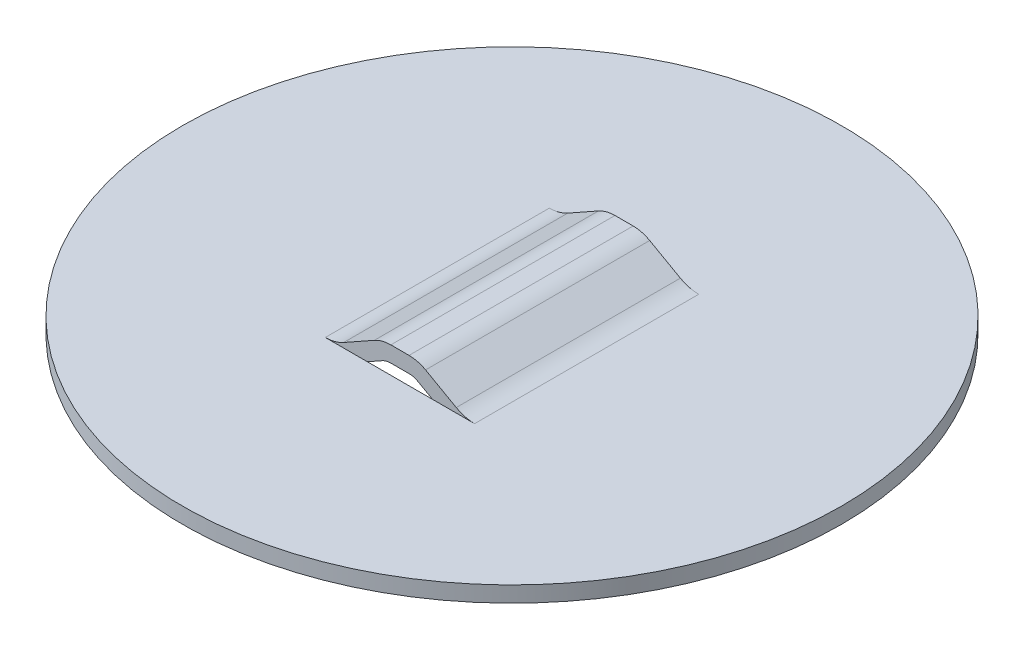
ISO-10303-21;
HEADER;
FILE_DESCRIPTION(('STEP AP214'),'2;1');
FILE_NAME('part.step','',(''),(''),'','','');
FILE_SCHEMA(('AUTOMOTIVE_DESIGN { 1 0 10303 214 1 1 1 1 }'));
ENDSEC;
DATA;
#1=APPLICATION_CONTEXT('core data for automotive mechanical design processes');
#2=APPLICATION_PROTOCOL_DEFINITION('international standard','automotive_design',2000,#1);
#3=PRODUCT_CONTEXT('',#1,'mechanical');
#4=PRODUCT('Part','Part','',(#3));
#5=PRODUCT_RELATED_PRODUCT_CATEGORY('part','',(#4));
#6=PRODUCT_DEFINITION_FORMATION('','',#4);
#7=PRODUCT_DEFINITION_CONTEXT('part definition',#1,'design');
#8=PRODUCT_DEFINITION('design','',#6,#7);
#9=PRODUCT_DEFINITION_SHAPE('','',#8);
#10=(LENGTH_UNIT() NAMED_UNIT(*) SI_UNIT(.MILLI.,.METRE.));
#11=(NAMED_UNIT(*) PLANE_ANGLE_UNIT() SI_UNIT($,.RADIAN.));
#12=(NAMED_UNIT(*) SI_UNIT($,.STERADIAN.) SOLID_ANGLE_UNIT());
#13=UNCERTAINTY_MEASURE_WITH_UNIT(LENGTH_MEASURE(1.E-05),#10,'distance_accuracy_value','');
#14=(GEOMETRIC_REPRESENTATION_CONTEXT(3) GLOBAL_UNCERTAINTY_ASSIGNED_CONTEXT((#13)) GLOBAL_UNIT_ASSIGNED_CONTEXT((#10,
#11,#12)) REPRESENTATION_CONTEXT('',''));
#15=CARTESIAN_POINT('',(0.,0.,0.));
#16=DIRECTION('',(0.,0.,1.));
#17=DIRECTION('',(1.,0.,0.));
#18=AXIS2_PLACEMENT_3D('',#15,#16,#17);
#19=CARTESIAN_POINT('',(-3.59608843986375,0.,10.795));
#20=DIRECTION('',(0.,-1.,0.));
#21=DIRECTION('',(1.,0.,0.));
#22=AXIS2_PLACEMENT_3D('',#19,#20,#21);
#23=PLANE('',#22);
#24=CARTESIAN_POINT('',(0.,0.,5.3975));
#25=DIRECTION('',(0.,-1.,0.));
#26=DIRECTION('',(1.,0.,0.));
#27=AXIS2_PLACEMENT_3D('',#24,#25,#26);
#28=CIRCLE('',#27,15.875);
#29=CARTESIAN_POINT('',(15.875,0.,5.3975));
#30=VERTEX_POINT('',#29);
#31=EDGE_CURVE('E243',#30,#30,#28,.T.);
#32=ORIENTED_EDGE('',*,*,#31,.F.);
#33=EDGE_LOOP('',(#32));
#34=FACE_BOUND('',#33,.T.);
#35=DIRECTION('',(-1.,0.,0.));
#36=VECTOR('',#35,1.);
#37=CARTESIAN_POINT('',(-3.59608843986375,0.,0.));
#38=LINE('',#37,#36);
#39=CARTESIAN_POINT('',(1.56845051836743,0.,0.));
#40=VERTEX_POINT('',#39);
#41=CARTESIAN_POINT('',(-1.56845051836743,0.,0.));
#42=VERTEX_POINT('',#41);
#43=EDGE_CURVE('E264',#40,#42,#38,.T.);
#44=ORIENTED_EDGE('',*,*,#43,.F.);
#45=DIRECTION('',(-1.,0.,0.));
#46=VECTOR('',#45,1.);
#47=CARTESIAN_POINT('',(0.438235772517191,0.,0.));
#48=LINE('',#47,#46);
#49=CARTESIAN_POINT('',(3.59608843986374,0.,0.));
#50=VERTEX_POINT('',#49);
#51=EDGE_CURVE('E11',#50,#40,#48,.T.);
#52=ORIENTED_EDGE('',*,*,#51,.F.);
#53=DIRECTION('',(0.,0.,-1.));
#54=VECTOR('',#53,1.);
#55=CARTESIAN_POINT('',(3.59608843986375,0.,10.795));
#56=LINE('',#55,#54);
#57=CARTESIAN_POINT('',(3.59608843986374,0.,10.795));
#58=VERTEX_POINT('',#57);
#59=EDGE_CURVE('E214',#58,#50,#56,.T.);
#60=ORIENTED_EDGE('',*,*,#59,.F.);
#61=DIRECTION('',(-1.,0.,0.));
#62=VECTOR('',#61,1.);
#63=CARTESIAN_POINT('',(0.438235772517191,0.,10.795));
#64=LINE('',#63,#62);
#65=CARTESIAN_POINT('',(1.56845051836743,0.,10.795));
#66=VERTEX_POINT('',#65);
#67=EDGE_CURVE('E168',#58,#66,#64,.T.);
#68=ORIENTED_EDGE('',*,*,#67,.T.);
#69=DIRECTION('',(-1.,0.,0.));
#70=VECTOR('',#69,1.);
#71=CARTESIAN_POINT('',(-3.59608843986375,0.,10.795));
#72=LINE('',#71,#70);
#73=CARTESIAN_POINT('',(-1.56845051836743,0.,10.795));
#74=VERTEX_POINT('',#73);
#75=EDGE_CURVE('E240',#66,#74,#72,.T.);
#76=ORIENTED_EDGE('',*,*,#75,.T.);
#77=CARTESIAN_POINT('',(-3.59608843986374,0.,10.795));
#78=VERTEX_POINT('',#77);
#79=EDGE_CURVE('E141',#74,#78,#64,.T.);
#80=ORIENTED_EDGE('',*,*,#79,.T.);
#81=DIRECTION('',(0.,0.,-1.));
#82=VECTOR('',#81,1.);
#83=CARTESIAN_POINT('',(-3.59608843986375,0.,10.795));
#84=LINE('',#83,#82);
#85=CARTESIAN_POINT('',(-3.59608843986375,0.,0.));
#86=VERTEX_POINT('',#85);
#87=EDGE_CURVE('E155',#78,#86,#84,.T.);
#88=ORIENTED_EDGE('',*,*,#87,.T.);
#89=EDGE_CURVE('E41',#42,#86,#48,.T.);
#90=ORIENTED_EDGE('',*,*,#89,.F.);
#91=EDGE_LOOP('',(#44,#52,#60,#68,#76,#80,#88,#90));
#92=FACE_BOUND('',#91,.T.);
#93=ADVANCED_FACE('F37',(#34,#92),#23,.F.);
#94=CARTESIAN_POINT('',(-3.59608843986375,-0.761999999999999,10.795));
#95=DIRECTION('',(0.,1.,0.));
#96=DIRECTION('',(-1.,0.,0.));
#97=AXIS2_PLACEMENT_3D('',#94,#95,#96);
#98=PLANE('',#97);
#99=CARTESIAN_POINT('',(0.,-0.761999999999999,5.3975));
#100=DIRECTION('',(0.,-1.,0.));
#101=DIRECTION('',(1.,0.,0.));
#102=AXIS2_PLACEMENT_3D('',#99,#100,#101);
#103=CIRCLE('',#102,15.875);
#104=CARTESIAN_POINT('',(15.875,-0.762,5.3975));
#105=VERTEX_POINT('',#104);
#106=EDGE_CURVE('E261',#105,#105,#103,.T.);
#107=ORIENTED_EDGE('',*,*,#106,.T.);
#108=EDGE_LOOP('',(#107));
#109=FACE_BOUND('',#108,.T.);
#110=DIRECTION('',(1.,0.,0.));
#111=VECTOR('',#110,1.);
#112=CARTESIAN_POINT('',(-3.59608843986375,-0.761999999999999,0.));
#113=LINE('',#112,#111);
#114=CARTESIAN_POINT('',(-3.59608843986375,-0.761999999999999,0.));
#115=VERTEX_POINT('',#114);
#116=CARTESIAN_POINT('',(3.59608843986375,-0.761999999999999,0.));
#117=VERTEX_POINT('',#116);
#118=EDGE_CURVE('E302',#115,#117,#113,.T.);
#119=ORIENTED_EDGE('',*,*,#118,.F.);
#120=DIRECTION('',(0.,0.,1.));
#121=VECTOR('',#120,1.);
#122=CARTESIAN_POINT('',(-3.59608843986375,-0.761999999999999,0.));
#123=LINE('',#122,#121);
#124=CARTESIAN_POINT('',(-3.59608843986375,-0.761999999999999,10.795));
#125=VERTEX_POINT('',#124);
#126=EDGE_CURVE('E271',#115,#125,#123,.T.);
#127=ORIENTED_EDGE('',*,*,#126,.T.);
#128=DIRECTION('',(1.,0.,0.));
#129=VECTOR('',#128,1.);
#130=CARTESIAN_POINT('',(-3.59608843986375,-0.761999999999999,10.795));
#131=LINE('',#130,#129);
#132=CARTESIAN_POINT('',(3.59608843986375,-0.761999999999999,10.795));
#133=VERTEX_POINT('',#132);
#134=EDGE_CURVE('E288',#125,#133,#131,.T.);
#135=ORIENTED_EDGE('',*,*,#134,.T.);
#136=DIRECTION('',(0.,0.,1.));
#137=VECTOR('',#136,1.);
#138=CARTESIAN_POINT('',(3.59608843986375,-0.761999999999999,0.));
#139=LINE('',#138,#137);
#140=EDGE_CURVE('E274',#117,#133,#139,.T.);
#141=ORIENTED_EDGE('',*,*,#140,.F.);
#142=EDGE_LOOP('',(#119,#127,#135,#141));
#143=FACE_BOUND('',#142,.T.);
#144=ADVANCED_FACE('F320',(#109,#143),#98,.F.);
#145=CARTESIAN_POINT('',(0.8612236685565,0.397318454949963,10.795));
#146=DIRECTION('',(0.489796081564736,0.87183702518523,0.));
#147=DIRECTION('',(-0.87183702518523,0.489796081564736,0.));
#148=AXIS2_PLACEMENT_3D('',#145,#146,#147);
#149=PLANE('',#148);
#150=DIRECTION('',(0.87183702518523,-0.489796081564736,0.));
#151=VECTOR('',#150,1.);
#152=CARTESIAN_POINT('',(0.8612236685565,0.397318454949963,0.));
#153=LINE('',#152,#151);
#154=CARTESIAN_POINT('',(0.8612236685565,0.397318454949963,0.));
#155=VERTEX_POINT('',#154);
#156=EDGE_CURVE('E167',#155,#40,#153,.T.);
#157=ORIENTED_EDGE('',*,*,#156,.T.);
#158=DIRECTION('',(-0.87183702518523,0.489796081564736,0.));
#159=VECTOR('',#158,1.);
#160=CARTESIAN_POINT('',(0.8612236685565,0.397318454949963,0.));
#161=LINE('',#160,#159);
#162=CARTESIAN_POINT('',(2.33956557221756,-0.433210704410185,0.));
#163=VERTEX_POINT('',#162);
#164=EDGE_CURVE('E296',#163,#40,#161,.T.);
#165=ORIENTED_EDGE('',*,*,#164,.F.);
#166=DIRECTION('',(0.,0.,1.));
#167=VECTOR('',#166,1.);
#168=CARTESIAN_POINT('',(2.33956557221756,-0.433210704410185,0.));
#169=LINE('',#168,#167);
#170=CARTESIAN_POINT('',(2.33956557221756,-0.433210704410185,10.795));
#171=VERTEX_POINT('',#170);
#172=EDGE_CURVE('E277',#163,#171,#169,.T.);
#173=ORIENTED_EDGE('',*,*,#172,.T.);
#174=DIRECTION('',(-0.87183702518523,0.489796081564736,0.));
#175=VECTOR('',#174,1.);
#176=CARTESIAN_POINT('',(0.8612236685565,0.397318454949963,10.795));
#177=LINE('',#176,#175);
#178=EDGE_CURVE('E285',#171,#66,#177,.T.);
#179=ORIENTED_EDGE('',*,*,#178,.T.);
#180=DIRECTION('',(0.87183702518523,-0.489796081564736,0.));
#181=VECTOR('',#180,1.);
#182=CARTESIAN_POINT('',(0.8612236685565,0.397318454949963,10.795));
#183=LINE('',#182,#181);
#184=CARTESIAN_POINT('',(0.8612236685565,0.397318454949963,10.795));
#185=VERTEX_POINT('',#184);
#186=EDGE_CURVE('E108',#185,#66,#183,.T.);
#187=ORIENTED_EDGE('',*,*,#186,.F.);
#188=DIRECTION('',(0.,0.,-1.));
#189=VECTOR('',#188,1.);
#190=CARTESIAN_POINT('',(0.8612236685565,0.397318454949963,10.795));
#191=LINE('',#190,#189);
#192=EDGE_CURVE('E216',#185,#155,#191,.T.);
#193=ORIENTED_EDGE('',*,*,#192,.T.);
#194=EDGE_LOOP('',(#157,#165,#173,#179,#187,#193));
#195=FACE_BOUND('',#194,.T.);
#196=ADVANCED_FACE('F369',(#195),#149,.F.);
#197=CARTESIAN_POINT('',(-0.8612236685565,0.397318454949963,10.795));
#198=DIRECTION('',(-0.489796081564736,0.87183702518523,0.));
#199=DIRECTION('',(-0.87183702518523,-0.489796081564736,0.));
#200=AXIS2_PLACEMENT_3D('',#197,#198,#199);
#201=PLANE('',#200);
#202=DIRECTION('',(0.87183702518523,0.489796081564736,0.));
#203=VECTOR('',#202,1.);
#204=CARTESIAN_POINT('',(-0.8612236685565,0.397318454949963,10.795));
#205=LINE('',#204,#203);
#206=CARTESIAN_POINT('',(-0.8612236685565,0.397318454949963,10.795));
#207=VERTEX_POINT('',#206);
#208=EDGE_CURVE('E131',#74,#207,#205,.T.);
#209=ORIENTED_EDGE('',*,*,#208,.F.);
#210=DIRECTION('',(-0.87183702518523,-0.489796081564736,0.));
#211=VECTOR('',#210,1.);
#212=CARTESIAN_POINT('',(-2.33956557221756,-0.433210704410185,10.795));
#213=LINE('',#212,#211);
#214=CARTESIAN_POINT('',(-2.33956557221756,-0.433210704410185,10.795));
#215=VERTEX_POINT('',#214);
#216=EDGE_CURVE('E282',#74,#215,#213,.T.);
#217=ORIENTED_EDGE('',*,*,#216,.T.);
#218=DIRECTION('',(0.,0.,1.));
#219=VECTOR('',#218,1.);
#220=CARTESIAN_POINT('',(-2.33956557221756,-0.433210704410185,0.));
#221=LINE('',#220,#219);
#222=CARTESIAN_POINT('',(-2.33956557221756,-0.433210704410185,0.));
#223=VERTEX_POINT('',#222);
#224=EDGE_CURVE('E270',#223,#215,#221,.T.);
#225=ORIENTED_EDGE('',*,*,#224,.F.);
#226=DIRECTION('',(-0.87183702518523,-0.489796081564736,0.));
#227=VECTOR('',#226,1.);
#228=CARTESIAN_POINT('',(-2.33956557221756,-0.433210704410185,0.));
#229=LINE('',#228,#227);
#230=EDGE_CURVE('E275',#42,#223,#229,.T.);
#231=ORIENTED_EDGE('',*,*,#230,.F.);
#232=DIRECTION('',(0.87183702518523,0.489796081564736,0.));
#233=VECTOR('',#232,1.);
#234=CARTESIAN_POINT('',(-0.8612236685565,0.397318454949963,0.));
#235=LINE('',#234,#233);
#236=CARTESIAN_POINT('',(-0.8612236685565,0.397318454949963,0.));
#237=VERTEX_POINT('',#236);
#238=EDGE_CURVE('E151',#42,#237,#235,.T.);
#239=ORIENTED_EDGE('',*,*,#238,.T.);
#240=DIRECTION('',(0.,0.,-1.));
#241=VECTOR('',#240,1.);
#242=CARTESIAN_POINT('',(-0.8612236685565,0.397318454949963,10.795));
#243=LINE('',#242,#241);
#244=EDGE_CURVE('E147',#207,#237,#243,.T.);
#245=ORIENTED_EDGE('',*,*,#244,.F.);
#246=EDGE_LOOP('',(#209,#217,#225,#231,#239,#245));
#247=FACE_BOUND('',#246,.T.);
#248=ADVANCED_FACE('F148',(#247),#201,.F.);
#249=CARTESIAN_POINT('',(0.438235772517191,-0.3556,10.795));
#250=DIRECTION('',(0.,0.,-1.));
#251=DIRECTION('',(-1.,0.,0.));
#252=AXIS2_PLACEMENT_3D('',#249,#250,#251);
#253=PLANE('',#252);
#254=ORIENTED_EDGE('',*,*,#67,.F.);
#255=CARTESIAN_POINT('',(3.59608843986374,1.8034,10.795));
#256=DIRECTION('',(0.,0.,-1.));
#257=DIRECTION('',(1.,0.,0.));
#258=AXIS2_PLACEMENT_3D('',#255,#256,#257);
#259=CIRCLE('',#258,1.8034);
#260=CARTESIAN_POINT('',(2.71279018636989,0.231129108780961,10.795));
#261=VERTEX_POINT('',#260);
#262=EDGE_CURVE('E257',#58,#261,#259,.T.);
#263=ORIENTED_EDGE('',*,*,#262,.T.);
#264=DIRECTION('',(-0.87183702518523,0.489796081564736,0.));
#265=VECTOR('',#264,1.);
#266=CARTESIAN_POINT('',(1.23444828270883,1.06165826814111,10.795));
#267=LINE('',#266,#265);
#268=CARTESIAN_POINT('',(1.23444828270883,1.06165826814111,10.795));
#269=VERTEX_POINT('',#268);
#270=EDGE_CURVE('E255',#261,#269,#267,.T.);
#271=ORIENTED_EDGE('',*,*,#270,.T.);
#272=CARTESIAN_POINT('',(0.438235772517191,-0.3556,10.795));
#273=DIRECTION('',(0.,0.,1.));
#274=DIRECTION('',(-1.,0.,0.));
#275=AXIS2_PLACEMENT_3D('',#272,#273,#274);
#276=CIRCLE('',#275,1.6256);
#277=CARTESIAN_POINT('',(0.438235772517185,1.27,10.795));
#278=VERTEX_POINT('',#277);
#279=EDGE_CURVE('E253',#269,#278,#276,.T.);
#280=ORIENTED_EDGE('',*,*,#279,.T.);
#281=DIRECTION('',(-1.,0.,0.));
#282=VECTOR('',#281,1.);
#283=CARTESIAN_POINT('',(0.,1.27,10.795));
#284=LINE('',#283,#282);
#285=CARTESIAN_POINT('',(-0.438235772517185,1.27,10.795));
#286=VERTEX_POINT('',#285);
#287=EDGE_CURVE('E251',#278,#286,#284,.T.);
#288=ORIENTED_EDGE('',*,*,#287,.T.);
#289=CARTESIAN_POINT('',(-0.438235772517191,-0.3556,10.795));
#290=DIRECTION('',(0.,0.,1.));
#291=DIRECTION('',(1.,0.,0.));
#292=AXIS2_PLACEMENT_3D('',#289,#290,#291);
#293=CIRCLE('',#292,1.6256);
#294=CARTESIAN_POINT('',(-1.23444828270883,1.06165826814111,10.795));
#295=VERTEX_POINT('',#294);
#296=EDGE_CURVE('E247',#286,#295,#293,.T.);
#297=ORIENTED_EDGE('',*,*,#296,.T.);
#298=DIRECTION('',(-0.87183702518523,-0.489796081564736,0.));
#299=VECTOR('',#298,1.);
#300=CARTESIAN_POINT('',(-1.23444828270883,1.06165826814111,10.795));
#301=LINE('',#300,#299);
#302=CARTESIAN_POINT('',(-2.71279018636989,0.231129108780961,10.795));
#303=VERTEX_POINT('',#302);
#304=EDGE_CURVE('E246',#295,#303,#301,.T.);
#305=ORIENTED_EDGE('',*,*,#304,.T.);
#306=CARTESIAN_POINT('',(-3.59608843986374,1.8034,10.795));
#307=DIRECTION('',(0.,0.,-1.));
#308=DIRECTION('',(-1.,0.,0.));
#309=AXIS2_PLACEMENT_3D('',#306,#307,#308);
#310=CIRCLE('',#309,1.8034);
#311=EDGE_CURVE('E144',#303,#78,#310,.T.);
#312=ORIENTED_EDGE('',*,*,#311,.T.);
#313=ORIENTED_EDGE('',*,*,#79,.F.);
#314=ORIENTED_EDGE('',*,*,#208,.T.);
#315=CARTESIAN_POINT('',(-0.438235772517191,-0.3556,10.795));
#316=DIRECTION('',(0.,0.,-1.));
#317=DIRECTION('',(1.,0.,0.));
#318=AXIS2_PLACEMENT_3D('',#315,#316,#317);
#319=CIRCLE('',#318,0.8636);
#320=CARTESIAN_POINT('',(-0.438235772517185,0.508,10.795));
#321=VERTEX_POINT('',#320);
#322=EDGE_CURVE('E136',#207,#321,#319,.T.);
#323=ORIENTED_EDGE('',*,*,#322,.T.);
#324=DIRECTION('',(1.,0.,0.));
#325=VECTOR('',#324,1.);
#326=CARTESIAN_POINT('',(0.,0.508,10.795));
#327=LINE('',#326,#325);
#328=CARTESIAN_POINT('',(0.438235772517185,0.508,10.795));
#329=VERTEX_POINT('',#328);
#330=EDGE_CURVE('E61',#321,#329,#327,.T.);
#331=ORIENTED_EDGE('',*,*,#330,.T.);
#332=CARTESIAN_POINT('',(0.438235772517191,-0.3556,10.795));
#333=DIRECTION('',(0.,0.,-1.));
#334=DIRECTION('',(-1.,0.,0.));
#335=AXIS2_PLACEMENT_3D('',#332,#333,#334);
#336=CIRCLE('',#335,0.8636);
#337=EDGE_CURVE('E191',#329,#185,#336,.T.);
#338=ORIENTED_EDGE('',*,*,#337,.T.);
#339=ORIENTED_EDGE('',*,*,#186,.T.);
#340=EDGE_LOOP('',(#254,#263,#271,#280,#288,#297,#305,#312,#313,#314,#323,#331,#338,#339));
#341=FACE_BOUND('',#340,.T.);
#342=ADVANCED_FACE('F134',(#341),#253,.F.);
#343=CARTESIAN_POINT('',(0.438235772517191,-0.3556,0.));
#344=DIRECTION('',(0.,0.,-1.));
#345=DIRECTION('',(-1.,0.,0.));
#346=AXIS2_PLACEMENT_3D('',#343,#344,#345);
#347=PLANE('',#346);
#348=CARTESIAN_POINT('',(3.59608843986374,1.8034,0.));
#349=DIRECTION('',(0.,0.,-1.));
#350=DIRECTION('',(1.,0.,0.));
#351=AXIS2_PLACEMENT_3D('',#348,#349,#350);
#352=CIRCLE('',#351,1.8034);
#353=CARTESIAN_POINT('',(2.71279018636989,0.231129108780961,0.));
#354=VERTEX_POINT('',#353);
#355=EDGE_CURVE('E171',#50,#354,#352,.T.);
#356=ORIENTED_EDGE('',*,*,#355,.F.);
#357=ORIENTED_EDGE('',*,*,#51,.T.);
#358=ORIENTED_EDGE('',*,*,#156,.F.);
#359=CARTESIAN_POINT('',(0.438235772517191,-0.3556,0.));
#360=DIRECTION('',(0.,0.,-1.));
#361=DIRECTION('',(-1.,0.,0.));
#362=AXIS2_PLACEMENT_3D('',#359,#360,#361);
#363=CIRCLE('',#362,0.8636);
#364=CARTESIAN_POINT('',(0.438235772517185,0.508,0.));
#365=VERTEX_POINT('',#364);
#366=EDGE_CURVE('E164',#365,#155,#363,.T.);
#367=ORIENTED_EDGE('',*,*,#366,.F.);
#368=DIRECTION('',(1.,0.,0.));
#369=VECTOR('',#368,1.);
#370=CARTESIAN_POINT('',(0.,0.508,0.));
#371=LINE('',#370,#369);
#372=CARTESIAN_POINT('',(-0.438235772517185,0.508,0.));
#373=VERTEX_POINT('',#372);
#374=EDGE_CURVE('E99',#373,#365,#371,.T.);
#375=ORIENTED_EDGE('',*,*,#374,.F.);
#376=CARTESIAN_POINT('',(-0.438235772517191,-0.3556,0.));
#377=DIRECTION('',(0.,0.,-1.));
#378=DIRECTION('',(1.,0.,0.));
#379=AXIS2_PLACEMENT_3D('',#376,#377,#378);
#380=CIRCLE('',#379,0.8636);
#381=EDGE_CURVE('E188',#237,#373,#380,.T.);
#382=ORIENTED_EDGE('',*,*,#381,.F.);
#383=ORIENTED_EDGE('',*,*,#238,.F.);
#384=ORIENTED_EDGE('',*,*,#89,.T.);
#385=CARTESIAN_POINT('',(-3.59608843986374,1.8034,0.));
#386=DIRECTION('',(0.,0.,-1.));
#387=DIRECTION('',(-1.,0.,0.));
#388=AXIS2_PLACEMENT_3D('',#385,#386,#387);
#389=CIRCLE('',#388,1.8034);
#390=CARTESIAN_POINT('',(-2.71279018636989,0.231129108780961,0.));
#391=VERTEX_POINT('',#390);
#392=EDGE_CURVE('E184',#391,#86,#389,.T.);
#393=ORIENTED_EDGE('',*,*,#392,.F.);
#394=DIRECTION('',(-0.87183702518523,-0.489796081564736,0.));
#395=VECTOR('',#394,1.);
#396=CARTESIAN_POINT('',(-1.23444828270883,1.06165826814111,0.));
#397=LINE('',#396,#395);
#398=CARTESIAN_POINT('',(-1.23444828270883,1.06165826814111,0.));
#399=VERTEX_POINT('',#398);
#400=EDGE_CURVE('E182',#399,#391,#397,.T.);
#401=ORIENTED_EDGE('',*,*,#400,.F.);
#402=CARTESIAN_POINT('',(-0.438235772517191,-0.3556,0.));
#403=DIRECTION('',(0.,0.,1.));
#404=DIRECTION('',(1.,0.,0.));
#405=AXIS2_PLACEMENT_3D('',#402,#403,#404);
#406=CIRCLE('',#405,1.6256);
#407=CARTESIAN_POINT('',(-0.438235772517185,1.27,0.));
#408=VERTEX_POINT('',#407);
#409=EDGE_CURVE('E180',#408,#399,#406,.T.);
#410=ORIENTED_EDGE('',*,*,#409,.F.);
#411=DIRECTION('',(-1.,0.,0.));
#412=VECTOR('',#411,1.);
#413=CARTESIAN_POINT('',(0.,1.27,0.));
#414=LINE('',#413,#412);
#415=CARTESIAN_POINT('',(0.438235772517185,1.27,0.));
#416=VERTEX_POINT('',#415);
#417=EDGE_CURVE('E178',#416,#408,#414,.T.);
#418=ORIENTED_EDGE('',*,*,#417,.F.);
#419=CARTESIAN_POINT('',(0.438235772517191,-0.3556,0.));
#420=DIRECTION('',(0.,0.,1.));
#421=DIRECTION('',(-1.,0.,0.));
#422=AXIS2_PLACEMENT_3D('',#419,#420,#421);
#423=CIRCLE('',#422,1.6256);
#424=CARTESIAN_POINT('',(1.23444828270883,1.06165826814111,0.));
#425=VERTEX_POINT('',#424);
#426=EDGE_CURVE('E175',#425,#416,#423,.T.);
#427=ORIENTED_EDGE('',*,*,#426,.F.);
#428=DIRECTION('',(-0.87183702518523,0.489796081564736,0.));
#429=VECTOR('',#428,1.);
#430=CARTESIAN_POINT('',(1.23444828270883,1.06165826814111,0.));
#431=LINE('',#430,#429);
#432=EDGE_CURVE('E173',#354,#425,#431,.T.);
#433=ORIENTED_EDGE('',*,*,#432,.F.);
#434=EDGE_LOOP('',(#356,#357,#358,#367,#375,#382,#383,#384,#393,#401,#410,#418,#427,#433));
#435=FACE_BOUND('',#434,.T.);
#436=ADVANCED_FACE('F224',(#435),#347,.T.);
#437=CARTESIAN_POINT('',(0.438235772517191,-0.3556,10.795));
#438=DIRECTION('',(0.,0.,-1.));
#439=DIRECTION('',(-1.,0.,0.));
#440=AXIS2_PLACEMENT_3D('',#437,#438,#439);
#441=CYLINDRICAL_SURFACE('',#440,0.8636);
#442=ORIENTED_EDGE('',*,*,#366,.T.);
#443=ORIENTED_EDGE('',*,*,#192,.F.);
#444=ORIENTED_EDGE('',*,*,#337,.F.);
#445=DIRECTION('',(0.,0.,-1.));
#446=VECTOR('',#445,1.);
#447=CARTESIAN_POINT('',(0.438235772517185,0.508,10.795));
#448=LINE('',#447,#446);
#449=EDGE_CURVE('E160',#329,#365,#448,.T.);
#450=ORIENTED_EDGE('',*,*,#449,.T.);
#451=EDGE_LOOP('',(#442,#443,#444,#450));
#452=FACE_BOUND('',#451,.T.);
#453=ADVANCED_FACE('F39',(#452),#441,.F.);
#454=CARTESIAN_POINT('',(3.59608843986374,1.8034,10.795));
#455=DIRECTION('',(0.,0.,-1.));
#456=DIRECTION('',(-1.,0.,0.));
#457=AXIS2_PLACEMENT_3D('',#454,#455,#456);
#458=CYLINDRICAL_SURFACE('',#457,1.8034);
#459=ORIENTED_EDGE('',*,*,#355,.T.);
#460=DIRECTION('',(0.,0.,-1.));
#461=VECTOR('',#460,1.);
#462=CARTESIAN_POINT('',(2.71279018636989,0.231129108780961,10.795));
#463=LINE('',#462,#461);
#464=EDGE_CURVE('E211',#261,#354,#463,.T.);
#465=ORIENTED_EDGE('',*,*,#464,.F.);
#466=ORIENTED_EDGE('',*,*,#262,.F.);
#467=ORIENTED_EDGE('',*,*,#59,.T.);
#468=EDGE_LOOP('',(#459,#465,#466,#467));
#469=FACE_BOUND('',#468,.T.);
#470=ADVANCED_FACE('F346',(#469),#458,.F.);
#471=CARTESIAN_POINT('',(1.23444828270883,1.06165826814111,10.795));
#472=DIRECTION('',(-0.489796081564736,-0.87183702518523,0.));
#473=DIRECTION('',(0.87183702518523,-0.489796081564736,0.));
#474=AXIS2_PLACEMENT_3D('',#471,#472,#473);
#475=PLANE('',#474);
#476=ORIENTED_EDGE('',*,*,#432,.T.);
#477=DIRECTION('',(0.,0.,-1.));
#478=VECTOR('',#477,1.);
#479=CARTESIAN_POINT('',(1.23444828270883,1.06165826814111,10.795));
#480=LINE('',#479,#478);
#481=EDGE_CURVE('E208',#269,#425,#480,.T.);
#482=ORIENTED_EDGE('',*,*,#481,.F.);
#483=ORIENTED_EDGE('',*,*,#270,.F.);
#484=ORIENTED_EDGE('',*,*,#464,.T.);
#485=EDGE_LOOP('',(#476,#482,#483,#484));
#486=FACE_BOUND('',#485,.T.);
#487=ADVANCED_FACE('F351',(#486),#475,.F.);
#488=CARTESIAN_POINT('',(0.438235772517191,-0.3556,10.795));
#489=DIRECTION('',(0.,0.,-1.));
#490=DIRECTION('',(-1.,0.,0.));
#491=AXIS2_PLACEMENT_3D('',#488,#489,#490);
#492=CYLINDRICAL_SURFACE('',#491,1.6256);
#493=ORIENTED_EDGE('',*,*,#426,.T.);
#494=DIRECTION('',(0.,0.,-1.));
#495=VECTOR('',#494,1.);
#496=CARTESIAN_POINT('',(0.438235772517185,1.27,10.795));
#497=LINE('',#496,#495);
#498=EDGE_CURVE('E205',#278,#416,#497,.T.);
#499=ORIENTED_EDGE('',*,*,#498,.F.);
#500=ORIENTED_EDGE('',*,*,#279,.F.);
#501=ORIENTED_EDGE('',*,*,#481,.T.);
#502=EDGE_LOOP('',(#493,#499,#500,#501));
#503=FACE_BOUND('',#502,.T.);
#504=ADVANCED_FACE('F357',(#503),#492,.T.);
#505=CARTESIAN_POINT('',(0.,1.27,10.795));
#506=DIRECTION('',(0.,-1.,0.));
#507=DIRECTION('',(1.,0.,0.));
#508=AXIS2_PLACEMENT_3D('',#505,#506,#507);
#509=PLANE('',#508);
#510=ORIENTED_EDGE('',*,*,#417,.T.);
#511=DIRECTION('',(0.,0.,-1.));
#512=VECTOR('',#511,1.);
#513=CARTESIAN_POINT('',(-0.438235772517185,1.27,10.795));
#514=LINE('',#513,#512);
#515=EDGE_CURVE('E202',#286,#408,#514,.T.);
#516=ORIENTED_EDGE('',*,*,#515,.F.);
#517=ORIENTED_EDGE('',*,*,#287,.F.);
#518=ORIENTED_EDGE('',*,*,#498,.T.);
#519=EDGE_LOOP('',(#510,#516,#517,#518));
#520=FACE_BOUND('',#519,.T.);
#521=ADVANCED_FACE('F360',(#520),#509,.F.);
#522=CARTESIAN_POINT('',(-0.438235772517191,-0.3556,10.795));
#523=DIRECTION('',(0.,0.,-1.));
#524=DIRECTION('',(-1.,0.,0.));
#525=AXIS2_PLACEMENT_3D('',#522,#523,#524);
#526=CYLINDRICAL_SURFACE('',#525,1.6256);
#527=ORIENTED_EDGE('',*,*,#409,.T.);
#528=DIRECTION('',(0.,0.,-1.));
#529=VECTOR('',#528,1.);
#530=CARTESIAN_POINT('',(-1.23444828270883,1.06165826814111,10.795));
#531=LINE('',#530,#529);
#532=EDGE_CURVE('E199',#295,#399,#531,.T.);
#533=ORIENTED_EDGE('',*,*,#532,.F.);
#534=ORIENTED_EDGE('',*,*,#296,.F.);
#535=ORIENTED_EDGE('',*,*,#515,.T.);
#536=EDGE_LOOP('',(#527,#533,#534,#535));
#537=FACE_BOUND('',#536,.T.);
#538=ADVANCED_FACE('F365',(#537),#526,.T.);
#539=CARTESIAN_POINT('',(-1.23444828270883,1.06165826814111,10.795));
#540=DIRECTION('',(0.489796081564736,-0.87183702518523,0.));
#541=DIRECTION('',(0.87183702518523,0.489796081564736,0.));
#542=AXIS2_PLACEMENT_3D('',#539,#540,#541);
#543=PLANE('',#542);
#544=ORIENTED_EDGE('',*,*,#400,.T.);
#545=DIRECTION('',(0.,0.,-1.));
#546=VECTOR('',#545,1.);
#547=CARTESIAN_POINT('',(-2.71279018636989,0.231129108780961,10.795));
#548=LINE('',#547,#546);
#549=EDGE_CURVE('E196',#303,#391,#548,.T.);
#550=ORIENTED_EDGE('',*,*,#549,.F.);
#551=ORIENTED_EDGE('',*,*,#304,.F.);
#552=ORIENTED_EDGE('',*,*,#532,.T.);
#553=EDGE_LOOP('',(#544,#550,#551,#552));
#554=FACE_BOUND('',#553,.T.);
#555=ADVANCED_FACE('F367',(#554),#543,.F.);
#556=CARTESIAN_POINT('',(-3.59608843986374,1.8034,10.795));
#557=DIRECTION('',(0.,0.,-1.));
#558=DIRECTION('',(-1.,0.,0.));
#559=AXIS2_PLACEMENT_3D('',#556,#557,#558);
#560=CYLINDRICAL_SURFACE('',#559,1.8034);
#561=ORIENTED_EDGE('',*,*,#392,.T.);
#562=ORIENTED_EDGE('',*,*,#87,.F.);
#563=ORIENTED_EDGE('',*,*,#311,.F.);
#564=ORIENTED_EDGE('',*,*,#549,.T.);
#565=EDGE_LOOP('',(#561,#562,#563,#564));
#566=FACE_BOUND('',#565,.T.);
#567=ADVANCED_FACE('F233',(#566),#560,.F.);
#568=CARTESIAN_POINT('',(-0.438235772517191,-0.3556,10.795));
#569=DIRECTION('',(0.,0.,-1.));
#570=DIRECTION('',(-1.,0.,0.));
#571=AXIS2_PLACEMENT_3D('',#568,#569,#570);
#572=CYLINDRICAL_SURFACE('',#571,0.8636);
#573=ORIENTED_EDGE('',*,*,#381,.T.);
#574=DIRECTION('',(0.,0.,-1.));
#575=VECTOR('',#574,1.);
#576=CARTESIAN_POINT('',(-0.438235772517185,0.508,10.795));
#577=LINE('',#576,#575);
#578=EDGE_CURVE('E156',#321,#373,#577,.T.);
#579=ORIENTED_EDGE('',*,*,#578,.F.);
#580=ORIENTED_EDGE('',*,*,#322,.F.);
#581=ORIENTED_EDGE('',*,*,#244,.T.);
#582=EDGE_LOOP('',(#573,#579,#580,#581));
#583=FACE_BOUND('',#582,.T.);
#584=ADVANCED_FACE('F158',(#583),#572,.F.);
#585=CARTESIAN_POINT('',(0.,0.508,10.795));
#586=DIRECTION('',(0.,1.,0.));
#587=DIRECTION('',(0.,0.,1.));
#588=AXIS2_PLACEMENT_3D('',#585,#586,#587);
#589=PLANE('',#588);
#590=ORIENTED_EDGE('',*,*,#374,.T.);
#591=ORIENTED_EDGE('',*,*,#449,.F.);
#592=ORIENTED_EDGE('',*,*,#330,.F.);
#593=ORIENTED_EDGE('',*,*,#578,.T.);
#594=EDGE_LOOP('',(#590,#591,#592,#593));
#595=FACE_BOUND('',#594,.T.);
#596=ADVANCED_FACE('F417',(#595),#589,.F.);
#597=CARTESIAN_POINT('',(0.,0.,5.3975));
#598=DIRECTION('',(0.,-1.,0.));
#599=DIRECTION('',(1.,0.,0.));
#600=AXIS2_PLACEMENT_3D('',#597,#598,#599);
#601=CYLINDRICAL_SURFACE('',#600,15.875);
#602=ORIENTED_EDGE('',*,*,#31,.T.);
#603=EDGE_LOOP('',(#602));
#604=FACE_BOUND('',#603,.T.);
#605=ORIENTED_EDGE('',*,*,#106,.F.);
#606=EDGE_LOOP('',(#605));
#607=FACE_BOUND('',#606,.T.);
#608=ADVANCED_FACE('F420',(#604,#607),#601,.T.);
#609=CARTESIAN_POINT('',(-3.59608843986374,1.8034,0.));
#610=DIRECTION('',(0.,0.,1.));
#611=DIRECTION('',(1.,0.,0.));
#612=AXIS2_PLACEMENT_3D('',#609,#610,#611);
#613=PLANE('',#612);
#614=ORIENTED_EDGE('',*,*,#43,.T.);
#615=ORIENTED_EDGE('',*,*,#230,.T.);
#616=CARTESIAN_POINT('',(-3.59608843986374,1.8034,0.));
#617=DIRECTION('',(0.,0.,-1.));
#618=DIRECTION('',(1.,0.,0.));
#619=AXIS2_PLACEMENT_3D('',#616,#617,#618);
#620=CIRCLE('',#619,2.5654);
#621=EDGE_CURVE('E284',#223,#115,#620,.T.);
#622=ORIENTED_EDGE('',*,*,#621,.T.);
#623=ORIENTED_EDGE('',*,*,#118,.T.);
#624=CARTESIAN_POINT('',(3.59608843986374,1.8034,0.));
#625=DIRECTION('',(0.,0.,-1.));
#626=DIRECTION('',(1.,0.,0.));
#627=AXIS2_PLACEMENT_3D('',#624,#625,#626);
#628=CIRCLE('',#627,2.5654);
#629=EDGE_CURVE('E299',#117,#163,#628,.T.);
#630=ORIENTED_EDGE('',*,*,#629,.T.);
#631=ORIENTED_EDGE('',*,*,#164,.T.);
#632=EDGE_LOOP('',(#614,#615,#622,#623,#630,#631));
#633=FACE_BOUND('',#632,.T.);
#634=ADVANCED_FACE('F310',(#633),#613,.T.);
#635=CARTESIAN_POINT('',(-3.59608843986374,1.8034,10.795));
#636=DIRECTION('',(0.,0.,1.));
#637=DIRECTION('',(1.,0.,0.));
#638=AXIS2_PLACEMENT_3D('',#635,#636,#637);
#639=PLANE('',#638);
#640=ORIENTED_EDGE('',*,*,#178,.F.);
#641=CARTESIAN_POINT('',(3.59608843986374,1.8034,10.795));
#642=DIRECTION('',(0.,0.,-1.));
#643=DIRECTION('',(1.,0.,0.));
#644=AXIS2_PLACEMENT_3D('',#641,#642,#643);
#645=CIRCLE('',#644,2.5654);
#646=EDGE_CURVE('E52',#133,#171,#645,.T.);
#647=ORIENTED_EDGE('',*,*,#646,.F.);
#648=ORIENTED_EDGE('',*,*,#134,.F.);
#649=CARTESIAN_POINT('',(-3.59608843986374,1.8034,10.795));
#650=DIRECTION('',(0.,0.,-1.));
#651=DIRECTION('',(1.,0.,0.));
#652=AXIS2_PLACEMENT_3D('',#649,#650,#651);
#653=CIRCLE('',#652,2.5654);
#654=EDGE_CURVE('E291',#215,#125,#653,.T.);
#655=ORIENTED_EDGE('',*,*,#654,.F.);
#656=ORIENTED_EDGE('',*,*,#216,.F.);
#657=ORIENTED_EDGE('',*,*,#75,.F.);
#658=EDGE_LOOP('',(#640,#647,#648,#655,#656,#657));
#659=FACE_BOUND('',#658,.T.);
#660=ADVANCED_FACE('F370',(#659),#639,.F.);
#661=CARTESIAN_POINT('',(-3.59608843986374,1.8034,0.));
#662=DIRECTION('',(0.,0.,1.));
#663=DIRECTION('',(1.,0.,0.));
#664=AXIS2_PLACEMENT_3D('',#661,#662,#663);
#665=CYLINDRICAL_SURFACE('',#664,2.5654);
#666=ORIENTED_EDGE('',*,*,#654,.T.);
#667=ORIENTED_EDGE('',*,*,#126,.F.);
#668=ORIENTED_EDGE('',*,*,#621,.F.);
#669=ORIENTED_EDGE('',*,*,#224,.T.);
#670=EDGE_LOOP('',(#666,#667,#668,#669));
#671=FACE_BOUND('',#670,.T.);
#672=ADVANCED_FACE('F372',(#671),#665,.T.);
#673=CARTESIAN_POINT('',(3.59608843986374,1.8034,0.));
#674=DIRECTION('',(0.,0.,1.));
#675=DIRECTION('',(1.,0.,0.));
#676=AXIS2_PLACEMENT_3D('',#673,#674,#675);
#677=CYLINDRICAL_SURFACE('',#676,2.5654);
#678=ORIENTED_EDGE('',*,*,#646,.T.);
#679=ORIENTED_EDGE('',*,*,#172,.F.);
#680=ORIENTED_EDGE('',*,*,#629,.F.);
#681=ORIENTED_EDGE('',*,*,#140,.T.);
#682=EDGE_LOOP('',(#678,#679,#680,#681));
#683=FACE_BOUND('',#682,.T.);
#684=ADVANCED_FACE('F326',(#683),#677,.T.);
#685=CLOSED_SHELL('',(#93,#144,#196,#248,#342,#436,#453,#470,#487,#504,#521,#538,#555,#567,#584,
#596,#608,#634,#660,#672,#684));
#686=MANIFOLD_SOLID_BREP('B2',#685);
#687=ADVANCED_BREP_SHAPE_REPRESENTATION('',(#18,#686),#14);
#688=SHAPE_DEFINITION_REPRESENTATION(#9,#687);
ENDSEC;
END-ISO-10303-21;
